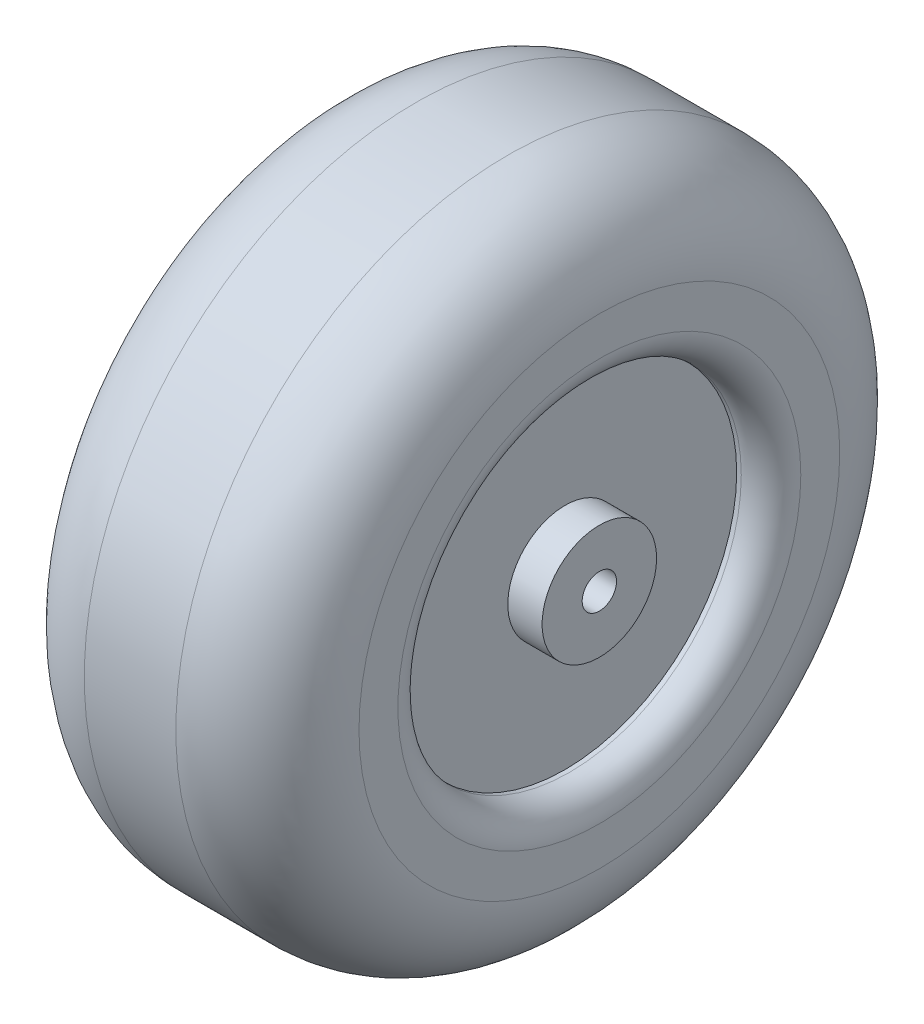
from build123d import *

# Parameters (mm, degrees)
ESQUISSE3_R             = 14.5
ESQUISSE3_R_2           = 0.75
BOSS_EXTRU_1_DEPTH      = 12
ESQUISSE4_R             = 7.5
ESQUISSE4_R_2           = 2.5
ENL_V_MAT_EXTRU_1_DEPTH = 1.5
ENL_V_START             = -1.5
ESQUISSE5_R             = 7.5
ESQUISSE5_R_2           = 2.5
ENL_V_MAT_EXTRU_2_DEPTH = 1.5
CONG_1_R                = 4
CONG_2_R                = 1.3


with BuildPart() as part:
    # Esquisse3 → Boss.-Extru.1 (new body)
    with BuildSketch(Plane(origin=(0, 0, 0), x_dir=(0, 0, -1), z_dir=(1, 0, 0))):
        Circle(ESQUISSE3_R)
        Circle(ESQUISSE3_R_2, mode=Mode.SUBTRACT)
    extrude(amount=BOSS_EXTRU_1_DEPTH)

    # Esquisse4 → Enl_v. mat.-Extru.1 (cut)
    with BuildSketch(Plane(origin=(12, 0, 0), x_dir=(0, 0, -1), z_dir=(1, 0, 0))):
        Circle(ESQUISSE4_R)
        Circle(ESQUISSE4_R_2, mode=Mode.SUBTRACT)
    extrude(amount=-ENL_V_MAT_EXTRU_1_DEPTH, mode=Mode.SUBTRACT)

    # Esquisse5 → Enl_v. mat.-Extru.2 (cut)
    with BuildSketch(Plane.ZY.offset(ENL_V_START)):
        with Locations(Location((0, 0, 0), (0, 0, 180))):
            Circle(ESQUISSE5_R)
        with Locations(Location((0, 0, 0), (0, 0, 180))):
            Circle(ESQUISSE5_R_2, mode=Mode.SUBTRACT)
    extrude(amount=ENL_V_MAT_EXTRU_2_DEPTH, mode=Mode.SUBTRACT)

    # Cong_1
    cong_1_edges = [part.edges().sort_by_distance(p)[0] for p in [
        (0, 0, 14.5),
        (12, 0, 14.5),
    ]]
    fillet(cong_1_edges, radius=CONG_1_R)

    # Cong_2
    cong_2_edges = [part.edges().sort_by_distance(p)[0] for p in [
        (12, 0, 7.5),
        (0, 0, 7.5),
    ]]
    fillet(cong_2_edges, radius=CONG_2_R)


solid = part.part
